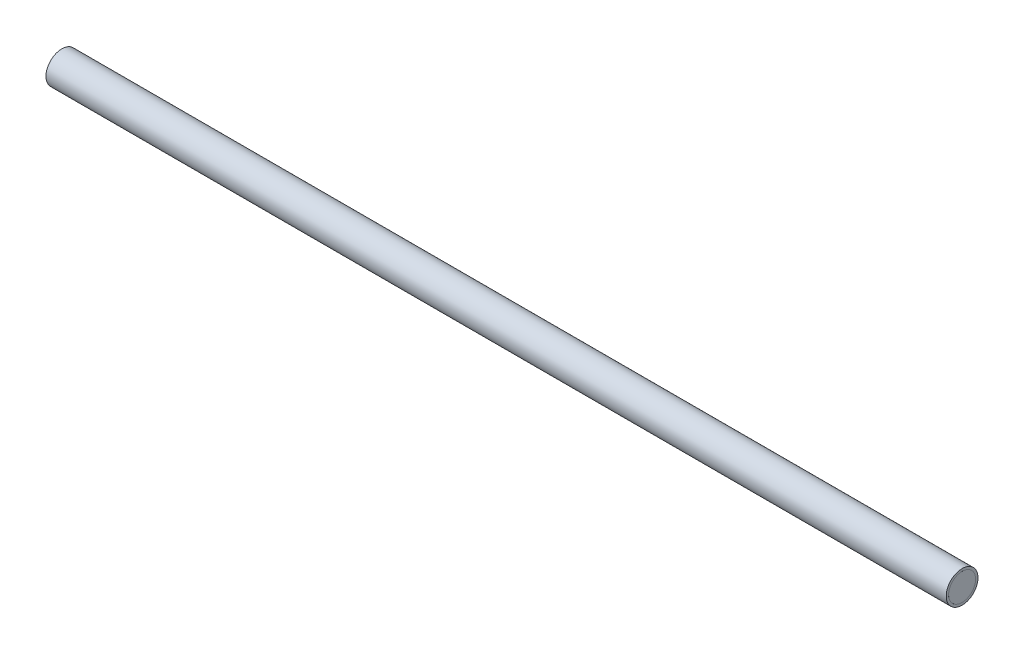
ISO-10303-21;
HEADER;
FILE_DESCRIPTION(('STEP AP214'),'2;1');
FILE_NAME('part.step','',(''),(''),'','','');
FILE_SCHEMA(('AUTOMOTIVE_DESIGN { 1 0 10303 214 1 1 1 1 }'));
ENDSEC;
DATA;
#1=APPLICATION_CONTEXT('core data for automotive mechanical design processes');
#2=APPLICATION_PROTOCOL_DEFINITION('international standard','automotive_design',2000,#1);
#3=PRODUCT_CONTEXT('',#1,'mechanical');
#4=PRODUCT('Part','Part','',(#3));
#5=PRODUCT_RELATED_PRODUCT_CATEGORY('part','',(#4));
#6=PRODUCT_DEFINITION_FORMATION('','',#4);
#7=PRODUCT_DEFINITION_CONTEXT('part definition',#1,'design');
#8=PRODUCT_DEFINITION('design','',#6,#7);
#9=PRODUCT_DEFINITION_SHAPE('','',#8);
#10=(LENGTH_UNIT() NAMED_UNIT(*) SI_UNIT(.MILLI.,.METRE.));
#11=(NAMED_UNIT(*) PLANE_ANGLE_UNIT() SI_UNIT($,.RADIAN.));
#12=(NAMED_UNIT(*) SI_UNIT($,.STERADIAN.) SOLID_ANGLE_UNIT());
#13=UNCERTAINTY_MEASURE_WITH_UNIT(LENGTH_MEASURE(1.E-05),#10,'distance_accuracy_value','');
#14=(GEOMETRIC_REPRESENTATION_CONTEXT(3) GLOBAL_UNCERTAINTY_ASSIGNED_CONTEXT((#13)) GLOBAL_UNIT_ASSIGNED_CONTEXT((#10,
#11,#12)) REPRESENTATION_CONTEXT('',''));
#15=CARTESIAN_POINT('',(0.,0.,0.));
#16=DIRECTION('',(0.,0.,1.));
#17=DIRECTION('',(1.,0.,0.));
#18=AXIS2_PLACEMENT_3D('',#15,#16,#17);
#19=CARTESIAN_POINT('',(-42.5,0.,0.));
#20=DIRECTION('',(1.,0.,0.));
#21=DIRECTION('',(0.,0.,-1.));
#22=AXIS2_PLACEMENT_3D('',#19,#20,#21);
#23=CYLINDRICAL_SURFACE('',#22,1.5);
#24=CARTESIAN_POINT('',(42.5,0.,0.));
#25=DIRECTION('',(1.,0.,0.));
#26=DIRECTION('',(0.,0.,-1.));
#27=AXIS2_PLACEMENT_3D('',#24,#25,#26);
#28=CIRCLE('',#27,1.5);
#29=CARTESIAN_POINT('',(42.5,0.,-1.5));
#30=VERTEX_POINT('',#29);
#31=EDGE_CURVE('P0_E21',#30,#30,#28,.F.);
#32=ORIENTED_EDGE('',*,*,#31,.T.);
#33=EDGE_LOOP('',(#32));
#34=FACE_BOUND('',#33,.T.);
#35=CARTESIAN_POINT('',(-42.5,0.,0.));
#36=DIRECTION('',(1.,0.,0.));
#37=DIRECTION('',(0.,0.,-1.));
#38=AXIS2_PLACEMENT_3D('',#35,#36,#37);
#39=CIRCLE('',#38,1.5);
#40=CARTESIAN_POINT('',(-42.5,0.,-1.5));
#41=VERTEX_POINT('',#40);
#42=EDGE_CURVE('P0_E11',#41,#41,#39,.T.);
#43=ORIENTED_EDGE('',*,*,#42,.T.);
#44=EDGE_LOOP('',(#43));
#45=FACE_BOUND('',#44,.T.);
#46=ADVANCED_FACE('P0_F17',(#34,#45),#23,.T.);
#47=CARTESIAN_POINT('',(42.5,0.,0.));
#48=DIRECTION('',(1.,0.,0.));
#49=DIRECTION('',(0.,0.,-1.));
#50=AXIS2_PLACEMENT_3D('',#47,#48,#49);
#51=PLANE('',#50);
#52=CARTESIAN_POINT('',(42.5,1.275,0.));
#53=CARTESIAN_POINT('',(42.5,1.27479744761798,-0.243442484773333));
#54=CARTESIAN_POINT('',(42.5,1.1854800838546,-0.469320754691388));
#55=CARTESIAN_POINT('',(42.5,1.08857411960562,-0.714390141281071));
#56=CARTESIAN_POINT('',(42.5,0.901561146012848,-0.901561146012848));
#57=CARTESIAN_POINT('',(42.5,0.715293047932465,-1.08798664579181));
#58=CARTESIAN_POINT('',(42.5,0.469320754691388,-1.1854800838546));
#59=CARTESIAN_POINT('',(42.5,0.243721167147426,-1.27489860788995));
#60=CARTESIAN_POINT('',(42.5,0.,-1.275));
#61=CARTESIAN_POINT('',(42.5,-0.242674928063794,-1.27510095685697));
#62=CARTESIAN_POINT('',(42.5,-0.469320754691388,-1.1854800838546));
#63=CARTESIAN_POINT('',(42.5,-0.714390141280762,-1.08857411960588));
#64=CARTESIAN_POINT('',(42.5,-0.901561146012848,-0.901561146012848));
#65=CARTESIAN_POINT('',(42.5,-1.08798664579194,-0.715293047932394));
#66=CARTESIAN_POINT('',(42.5,-1.1854800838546,-0.469320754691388));
#67=CARTESIAN_POINT('',(42.5,-1.27479700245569,-0.243977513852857));
#68=CARTESIAN_POINT('',(42.5,-1.275,0.));
#69=B_SPLINE_CURVE_WITH_KNOTS('',2,(#52,#53,#54,#55,#56,#57,#58,#59,#60,#61,#62,#63,#64,#65,#66,
#67,#68),.UNSPECIFIED.,.F.,.F.,(3,2,2,2,2,2,2,2,3),(0.,0.125,0.25,0.375,0.5,0.625,0.75,0.875,
1.),.UNSPECIFIED.);
#70=CARTESIAN_POINT('',(42.5,1.275,0.));
#71=VERTEX_POINT('',#70);
#72=CARTESIAN_POINT('',(42.5,-1.275,0.));
#73=VERTEX_POINT('',#72);
#74=EDGE_CURVE('P0_E34',#71,#73,#69,.T.);
#75=ORIENTED_EDGE('',*,*,#74,.T.);
#76=CARTESIAN_POINT('',(42.5,-1.275,0.));
#77=CARTESIAN_POINT('',(42.5,-1.27479744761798,0.243442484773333));
#78=CARTESIAN_POINT('',(42.5,-1.1854800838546,0.469320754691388));
#79=CARTESIAN_POINT('',(42.5,-1.08857411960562,0.714390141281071));
#80=CARTESIAN_POINT('',(42.5,-0.901561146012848,0.901561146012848));
#81=CARTESIAN_POINT('',(42.5,-0.715293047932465,1.08798664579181));
#82=CARTESIAN_POINT('',(42.5,-0.469320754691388,1.1854800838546));
#83=CARTESIAN_POINT('',(42.5,-0.243721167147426,1.27489860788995));
#84=CARTESIAN_POINT('',(42.5,0.,1.275));
#85=CARTESIAN_POINT('',(42.5,0.242674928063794,1.27510095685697));
#86=CARTESIAN_POINT('',(42.5,0.469320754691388,1.1854800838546));
#87=CARTESIAN_POINT('',(42.5,0.714390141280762,1.08857411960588));
#88=CARTESIAN_POINT('',(42.5,0.901561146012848,0.901561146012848));
#89=CARTESIAN_POINT('',(42.5,1.08798664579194,0.715293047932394));
#90=CARTESIAN_POINT('',(42.5,1.1854800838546,0.469320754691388));
#91=CARTESIAN_POINT('',(42.5,1.27479700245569,0.243977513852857));
#92=CARTESIAN_POINT('',(42.5,1.275,0.));
#93=B_SPLINE_CURVE_WITH_KNOTS('',2,(#76,#77,#78,#79,#80,#81,#82,#83,#84,#85,#86,#87,#88,#89,#90,
#91,#92),.UNSPECIFIED.,.F.,.F.,(3,2,2,2,2,2,2,2,3),(0.,0.125,0.25,0.375,0.5,0.625,0.75,0.875,
1.),.UNSPECIFIED.);
#94=EDGE_CURVE('P0_E37',#73,#71,#93,.T.);
#95=ORIENTED_EDGE('',*,*,#94,.T.);
#96=EDGE_LOOP('',(#75,#95));
#97=FACE_BOUND('',#96,.T.);
#98=ORIENTED_EDGE('',*,*,#31,.F.);
#99=EDGE_LOOP('',(#98));
#100=FACE_BOUND('',#99,.T.);
#101=ADVANCED_FACE('P0_F18',(#97,#100),#51,.T.);
#102=OPEN_SHELL('',(#46,#101));
#103=SHELL_BASED_SURFACE_MODEL('P0_B1',(#102));
#104=CARTESIAN_POINT('',(-42.5,0.,0.));
#105=DIRECTION('',(1.,0.,0.));
#106=DIRECTION('',(0.,0.,-1.));
#107=AXIS2_PLACEMENT_3D('',#104,#105,#106);
#108=PLANE('',#107);
#109=CARTESIAN_POINT('',(-42.5,0.,0.));
#110=DIRECTION('',(1.,0.,0.));
#111=DIRECTION('',(0.,0.,-1.));
#112=AXIS2_PLACEMENT_3D('',#109,#110,#111);
#113=CIRCLE('',#112,1.275);
#114=CARTESIAN_POINT('',(-42.5,0.,-1.275));
#115=VERTEX_POINT('',#114);
#116=EDGE_CURVE('P1_E18',#115,#115,#113,.T.);
#117=ORIENTED_EDGE('',*,*,#116,.F.);
#118=EDGE_LOOP('',(#117));
#119=FACE_BOUND('',#118,.T.);
#120=ADVANCED_FACE('P1_F15',(#119),#108,.F.);
#121=CARTESIAN_POINT('',(42.5,0.,0.));
#122=DIRECTION('',(1.,0.,0.));
#123=DIRECTION('',(0.,0.,-1.));
#124=AXIS2_PLACEMENT_3D('',#121,#122,#123);
#125=PLANE('',#124);
#126=CARTESIAN_POINT('',(42.5,0.,0.));
#127=DIRECTION('',(1.,0.,0.));
#128=DIRECTION('',(0.,0.,-1.));
#129=AXIS2_PLACEMENT_3D('',#126,#127,#128);
#130=CIRCLE('',#129,1.275);
#131=CARTESIAN_POINT('',(42.5,0.,-1.275));
#132=VERTEX_POINT('',#131);
#133=EDGE_CURVE('P1_E10',#132,#132,#130,.F.);
#134=ORIENTED_EDGE('',*,*,#133,.F.);
#135=EDGE_LOOP('',(#134));
#136=FACE_BOUND('',#135,.T.);
#137=ADVANCED_FACE('P1_F33',(#136),#125,.T.);
#138=CARTESIAN_POINT('',(-46.75,0.,0.));
#139=DIRECTION('',(1.,0.,0.));
#140=DIRECTION('',(0.,0.,-1.));
#141=AXIS2_PLACEMENT_3D('',#138,#139,#140);
#142=CYLINDRICAL_SURFACE('',#141,1.275);
#143=ORIENTED_EDGE('',*,*,#133,.T.);
#144=EDGE_LOOP('',(#143));
#145=FACE_BOUND('',#144,.T.);
#146=ORIENTED_EDGE('',*,*,#116,.T.);
#147=EDGE_LOOP('',(#146));
#148=FACE_BOUND('',#147,.T.);
#149=ADVANCED_FACE('P1_F30',(#145,#148),#142,.T.);
#150=CLOSED_SHELL('',(#120,#137,#149));
#151=MANIFOLD_SOLID_BREP('P1_B1',#150);
#152=ADVANCED_BREP_SHAPE_REPRESENTATION('',(#18,#151),#14);
#153=MANIFOLD_SURFACE_SHAPE_REPRESENTATION('',(#18,#103),#14);
#154=SHAPE_REPRESENTATION('',(#18),#14);
#155=SHAPE_DEFINITION_REPRESENTATION(#9,#154);
#156=SHAPE_REPRESENTATION_RELATIONSHIP('','',#154,#152);
#157=SHAPE_REPRESENTATION_RELATIONSHIP('','',#154,#153);
ENDSEC;
END-ISO-10303-21;
